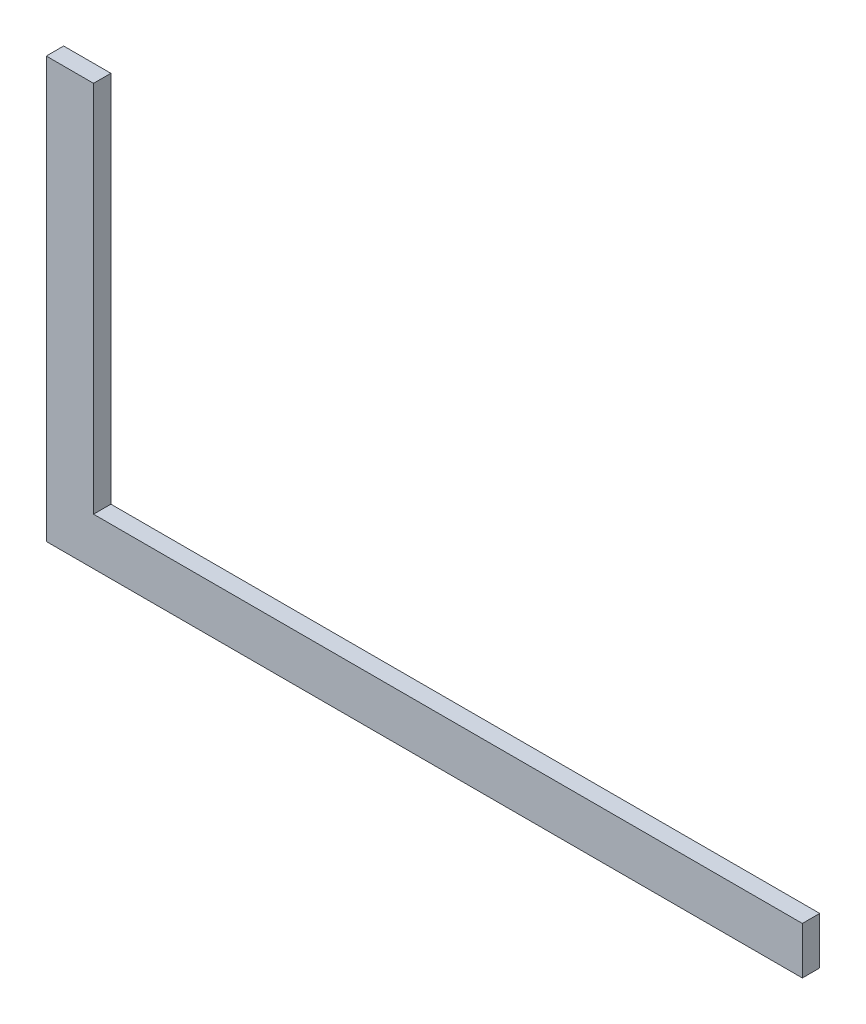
from build123d import *

# Parameters (mm, degrees)
BOSS_EXTRUDE1_DEPTH = 1.4


with BuildPart() as part:
    # Sketch1 → Boss-Extrude1 (new body)
    with BuildSketch(Plane.XY):
        Polygon((0, 0), (60.96, 0), (60.96, 3.81), (3.81, 3.81), (3.81, 33.8963), (0, 33.8963), align=None)
    extrude(amount=BOSS_EXTRUDE1_DEPTH)


solid = part.part
